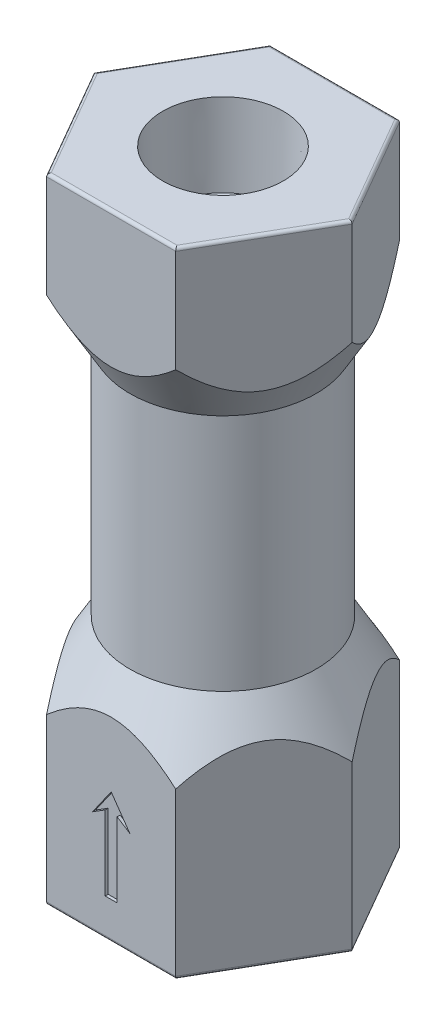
from build123d import *

# Parameters (mm, degrees)
BOSS_EXTRUDE1_DEPTH            = 53.975
F_5_6_5_6_DIAMETER_HOLE1_D     = 5.6
F_5_6_5_6_DIAMETER_HOLE1_DEPTH = 17.9705
F_5_6_5_6_DIAMETER_HOLE1_TIP   = 1.682409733
F_5_0_5_DIAMETER_HOLE1_D       = 5
FILLET1_R                      = 0.254
CUT_EXTRUDE1_DEPTH             = 0.254


with BuildPart() as part:
    # Sketch1 → Boss-Extrude1 (new body)
    with BuildSketch(Plane(origin=(0, 0, 0), x_dir=(1, 0, 0), z_dir=(0, 1, 0))):
        Polygon((-10.998522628, 0), (-5.499261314, -9.525), (5.499261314, -9.525), (10.998522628, 0), (5.499261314, 9.525), (-5.499261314, 9.525), align=None)
    extrude(amount=BOSS_EXTRUDE1_DEPTH)

    # Sketch3 → 1_8 NPT Tapped Hole1 (revolve, cut)
    with BuildSketch(Plane(origin=(0, 53.975, 0), x_dir=(0, 0, 1), z_dir=(1, 0, 0))):
        Polygon((0, 0), (0, 14.166668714), (4.2164, 11.6332), (4.2164, 6.9342), (4.936185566, 6.9342), (5.1438048, 0), align=None)
    revolve(axis=Axis((0, 60.325, 0), (0, -1, 0)), mode=Mode.SUBTRACT)

    # Sketch5 → 1_4 NPT Tapped Hole1 (revolve, cut)
    with BuildSketch(Plane(origin=(0, 0, 0), x_dir=(0, 0, -1), z_dir=(1, 0, 0))):
        Polygon((0, 0), (0, 20.436547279), (5.5626, 17.0942), (5.5626, 10.033), (6.557979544, 10.033), (6.858381, 0), align=None)
    revolve(axis=Axis((0, -6.35, 0), (0, 1, 0)), mode=Mode.SUBTRACT)

    # 5.6 _5.6_ Diameter Hole1
    with Locations(Plane(origin=(0, 53.975, 0), x_dir=(1, 0, 0), z_dir=(0, 1, 0))):
        with Locations((0, 0)):
            Hole(F_5_6_5_6_DIAMETER_HOLE1_D / 2, depth=F_5_6_5_6_DIAMETER_HOLE1_DEPTH)
            with Locations((0, 0, -(F_5_6_5_6_DIAMETER_HOLE1_DEPTH + F_5_6_5_6_DIAMETER_HOLE1_TIP / 2))):  # 118° drill point
                Cone(0, F_5_6_5_6_DIAMETER_HOLE1_D / 2, F_5_6_5_6_DIAMETER_HOLE1_TIP, mode=Mode.SUBTRACT)

    # 5.0 _5_ Diameter Hole1 (through all)
    with Locations(Plane(origin=(0, 53.975, 0), x_dir=(1, 0, 0), z_dir=(0, 1, 0))):
        with Locations((0, 0)):
            Hole(F_5_0_5_DIAMETER_HOLE1_D / 2)

    # Fillet1
    fillet1_edges = [part.edges().sort_by_distance(p)[0] for p in [
        (0, 53.975, 9.525),
        (8.248891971, 53.975, 4.7625),
        (8.248891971, 53.975, -4.7625),
        (0, 53.975, -9.525),
        (-8.248891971, 53.975, -4.7625),
        (0, 0, -9.525),
        (8.248891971, 0, -4.7625),
        (8.248891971, 0, 4.7625),
        (-8.248891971, 53.975, 4.7625),
        (0, 0, 9.525),
        (-8.248891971, 0, 4.7625),
        (-8.248891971, 0, -4.7625),
    ]]
    fillet(fillet1_edges, radius=FILLET1_R)

    # Sketch15 → Cut-Revolve1 (revolve, cut)
    with BuildSketch(Plane.XY, mode=Mode.PRIVATE) as cut_revolve1_sk:
        Polygon((-7.9375, 19.3675), (-7.9375, 39.6875), (-13.883042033, 49.98548088), (-13.883042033, 9.06951912), align=None)
    revolve(cut_revolve1_sk.sketch.rotate(Axis((0, 53.975, 0), (0, -1, 0)), 270), axis=Axis((0, 53.975, 0), (0, -1, 0)), mode=Mode.SUBTRACT)

    # Sketch16 → Cut-Extrude1 (cut)
    with BuildSketch(Plane.XY.offset(9.525)):
        Polygon((-0.508, 3.175), (-0.508, 9.525), (-1.5875, 8.845315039), (0, 11.1125), (1.5875, 8.845315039), (0.508, 9.525), (0.508, 3.175), align=None)
    extrude(amount=-CUT_EXTRUDE1_DEPTH, mode=Mode.SUBTRACT)


solid = part.part
